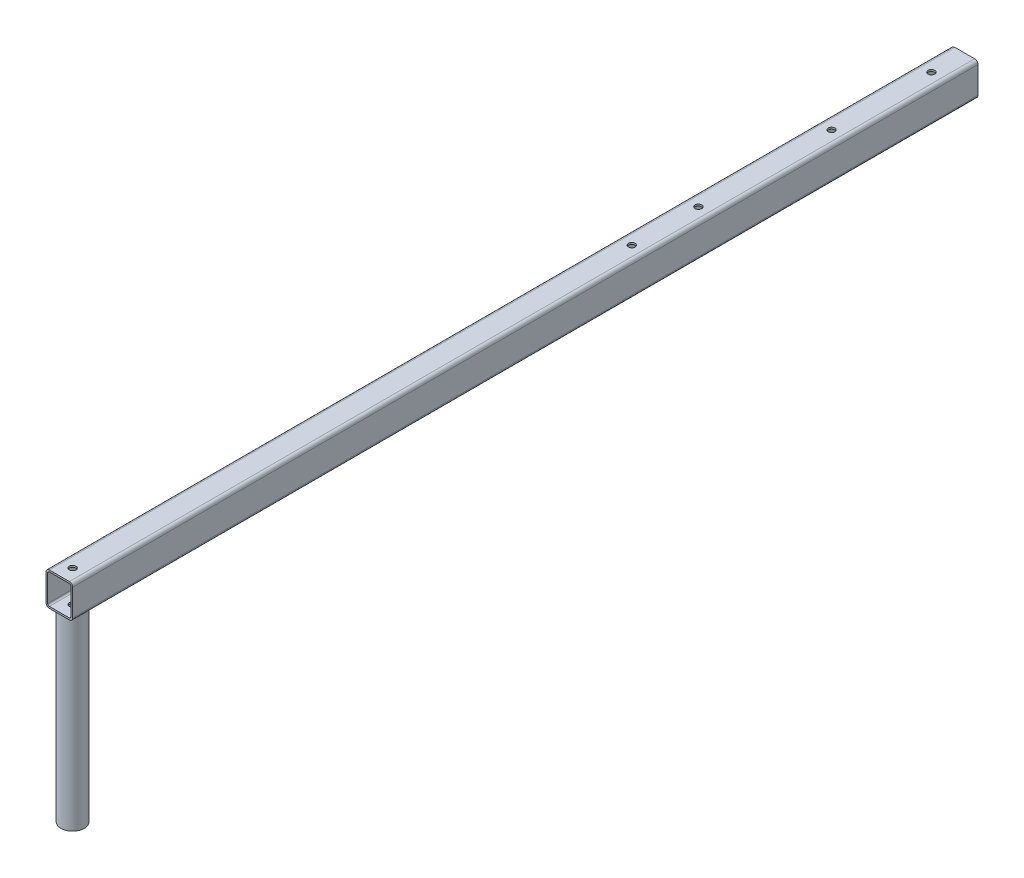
ISO-10303-21;
HEADER;
FILE_DESCRIPTION(('STEP AP214'),'2;1');
FILE_NAME('part.step','',(''),(''),'','','');
FILE_SCHEMA(('AUTOMOTIVE_DESIGN { 1 0 10303 214 1 1 1 1 }'));
ENDSEC;
DATA;
#1=APPLICATION_CONTEXT('core data for automotive mechanical design processes');
#2=APPLICATION_PROTOCOL_DEFINITION('international standard','automotive_design',2000,#1);
#3=PRODUCT_CONTEXT('',#1,'mechanical');
#4=PRODUCT('Part','Part','',(#3));
#5=PRODUCT_RELATED_PRODUCT_CATEGORY('part','',(#4));
#6=PRODUCT_DEFINITION_FORMATION('','',#4);
#7=PRODUCT_DEFINITION_CONTEXT('part definition',#1,'design');
#8=PRODUCT_DEFINITION('design','',#6,#7);
#9=PRODUCT_DEFINITION_SHAPE('','',#8);
#10=(LENGTH_UNIT() NAMED_UNIT(*) SI_UNIT(.MILLI.,.METRE.));
#11=(NAMED_UNIT(*) PLANE_ANGLE_UNIT() SI_UNIT($,.RADIAN.));
#12=(NAMED_UNIT(*) SI_UNIT($,.STERADIAN.) SOLID_ANGLE_UNIT());
#13=UNCERTAINTY_MEASURE_WITH_UNIT(LENGTH_MEASURE(1.E-05),#10,'distance_accuracy_value','');
#14=(GEOMETRIC_REPRESENTATION_CONTEXT(3) GLOBAL_UNCERTAINTY_ASSIGNED_CONTEXT((#13)) GLOBAL_UNIT_ASSIGNED_CONTEXT((#10,
#11,#12)) REPRESENTATION_CONTEXT('',''));
#15=CARTESIAN_POINT('',(0.,0.,0.));
#16=DIRECTION('',(0.,0.,1.));
#17=DIRECTION('',(1.,0.,0.));
#18=AXIS2_PLACEMENT_3D('',#15,#16,#17);
#19=CARTESIAN_POINT('',(0.,-193.675,850.9));
#20=DIRECTION('',(0.,1.,0.));
#21=DIRECTION('',(0.,0.,1.));
#22=AXIS2_PLACEMENT_3D('',#19,#20,#21);
#23=CYLINDRICAL_SURFACE('',#22,11.1125);
#24=CARTESIAN_POINT('',(0.,-193.675,850.9));
#25=DIRECTION('',(0.,1.,0.));
#26=DIRECTION('',(0.,0.,1.));
#27=AXIS2_PLACEMENT_3D('',#24,#25,#26);
#28=CIRCLE('',#27,11.1125);
#29=CARTESIAN_POINT('',(0.,-193.675,862.0125));
#30=VERTEX_POINT('',#29);
#31=EDGE_CURVE('E12',#30,#30,#28,.T.);
#32=ORIENTED_EDGE('',*,*,#31,.T.);
#33=EDGE_LOOP('',(#32));
#34=FACE_BOUND('',#33,.T.);
#35=CARTESIAN_POINT('',(0.,-15.875,850.9));
#36=DIRECTION('',(0.,1.,0.));
#37=DIRECTION('',(0.,0.,1.));
#38=AXIS2_PLACEMENT_3D('',#35,#36,#37);
#39=CIRCLE('',#38,11.1125);
#40=CARTESIAN_POINT('',(0.,-15.875,862.0125));
#41=VERTEX_POINT('',#40);
#42=EDGE_CURVE('E74',#41,#41,#39,.T.);
#43=ORIENTED_EDGE('',*,*,#42,.F.);
#44=EDGE_LOOP('',(#43));
#45=FACE_BOUND('',#44,.T.);
#46=ADVANCED_FACE('F71',(#34,#45),#23,.T.);
#47=CARTESIAN_POINT('',(0.,-193.675,850.9));
#48=DIRECTION('',(0.,1.,0.));
#49=DIRECTION('',(0.,0.,1.));
#50=AXIS2_PLACEMENT_3D('',#47,#48,#49);
#51=PLANE('',#50);
#52=CARTESIAN_POINT('',(0.,-193.675,850.9));
#53=DIRECTION('',(0.,1.,0.));
#54=DIRECTION('',(1.,0.,0.));
#55=AXIS2_PLACEMENT_3D('',#52,#53,#54);
#56=CIRCLE('',#55,9.46150000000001);
#57=CARTESIAN_POINT('',(9.46150000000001,-193.675,850.9));
#58=VERTEX_POINT('',#57);
#59=EDGE_CURVE('E81',#58,#58,#56,.T.);
#60=ORIENTED_EDGE('',*,*,#59,.T.);
#61=EDGE_LOOP('',(#60));
#62=FACE_BOUND('',#61,.T.);
#63=ORIENTED_EDGE('',*,*,#31,.F.);
#64=EDGE_LOOP('',(#63));
#65=FACE_BOUND('',#64,.T.);
#66=ADVANCED_FACE('F89',(#62,#65),#51,.F.);
#67=CARTESIAN_POINT('',(0.,-15.875,850.9));
#68=DIRECTION('',(0.,1.,0.));
#69=DIRECTION('',(0.,0.,1.));
#70=AXIS2_PLACEMENT_3D('',#67,#68,#69);
#71=PLANE('',#70);
#72=CARTESIAN_POINT('',(0.,-15.875,850.9));
#73=DIRECTION('',(0.,1.,0.));
#74=DIRECTION('',(1.,0.,0.));
#75=AXIS2_PLACEMENT_3D('',#72,#73,#74);
#76=CIRCLE('',#75,9.46150000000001);
#77=CARTESIAN_POINT('',(9.46150000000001,-15.875,850.9));
#78=VERTEX_POINT('',#77);
#79=EDGE_CURVE('E83',#78,#78,#76,.T.);
#80=ORIENTED_EDGE('',*,*,#79,.F.);
#81=EDGE_LOOP('',(#80));
#82=FACE_BOUND('',#81,.T.);
#83=ORIENTED_EDGE('',*,*,#42,.T.);
#84=EDGE_LOOP('',(#83));
#85=FACE_BOUND('',#84,.T.);
#86=ADVANCED_FACE('F95',(#82,#85),#71,.T.);
#87=CARTESIAN_POINT('',(0.,-193.675,850.9));
#88=DIRECTION('',(0.,1.,0.));
#89=DIRECTION('',(0.,0.,1.));
#90=AXIS2_PLACEMENT_3D('',#87,#88,#89);
#91=CYLINDRICAL_SURFACE('',#90,9.46150000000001);
#92=ORIENTED_EDGE('',*,*,#59,.F.);
#93=EDGE_LOOP('',(#92));
#94=FACE_BOUND('',#93,.T.);
#95=ORIENTED_EDGE('',*,*,#79,.T.);
#96=EDGE_LOOP('',(#95));
#97=FACE_BOUND('',#96,.T.);
#98=ADVANCED_FACE('F92',(#94,#97),#91,.F.);
#99=CLOSED_SHELL('',(#46,#66,#86,#98));
#100=MANIFOLD_SOLID_BREP('B2',#99);
#101=CARTESIAN_POINT('',(0.,0.,863.6));
#102=DIRECTION('',(0.,0.,1.));
#103=DIRECTION('',(1.,0.,0.));
#104=AXIS2_PLACEMENT_3D('',#101,#102,#103);
#105=PLANE('',#104);
#106=DIRECTION('',(1.,0.,0.));
#107=VECTOR('',#106,1.);
#108=CARTESIAN_POINT('',(12.7,-15.875,863.6));
#109=LINE('',#108,#107);
#110=CARTESIAN_POINT('',(-9.525,-15.875,863.6));
#111=VERTEX_POINT('',#110);
#112=CARTESIAN_POINT('',(9.525,-15.875,863.6));
#113=VERTEX_POINT('',#112);
#114=EDGE_CURVE('E427',#111,#113,#109,.T.);
#115=ORIENTED_EDGE('',*,*,#114,.T.);
#116=CARTESIAN_POINT('',(9.525,-12.7,863.6));
#117=DIRECTION('',(0.,0.,1.));
#118=DIRECTION('',(1.,0.,0.));
#119=AXIS2_PLACEMENT_3D('',#116,#117,#118);
#120=CIRCLE('',#119,3.175);
#121=CARTESIAN_POINT('',(12.7,-12.7,863.6));
#122=VERTEX_POINT('',#121);
#123=EDGE_CURVE('E301',#113,#122,#120,.T.);
#124=ORIENTED_EDGE('',*,*,#123,.T.);
#125=DIRECTION('',(0.,1.,0.));
#126=VECTOR('',#125,1.);
#127=CARTESIAN_POINT('',(12.7,15.875,863.6));
#128=LINE('',#127,#126);
#129=CARTESIAN_POINT('',(12.7,12.7,863.6));
#130=VERTEX_POINT('',#129);
#131=EDGE_CURVE('E269',#122,#130,#128,.T.);
#132=ORIENTED_EDGE('',*,*,#131,.T.);
#133=CARTESIAN_POINT('',(9.525,12.7,863.6));
#134=DIRECTION('',(0.,0.,1.));
#135=DIRECTION('',(1.,0.,0.));
#136=AXIS2_PLACEMENT_3D('',#133,#134,#135);
#137=CIRCLE('',#136,3.175);
#138=CARTESIAN_POINT('',(9.525,15.875,863.6));
#139=VERTEX_POINT('',#138);
#140=EDGE_CURVE('E295',#130,#139,#137,.T.);
#141=ORIENTED_EDGE('',*,*,#140,.T.);
#142=DIRECTION('',(-1.,0.,0.));
#143=VECTOR('',#142,1.);
#144=CARTESIAN_POINT('',(12.7,15.875,863.6));
#145=LINE('',#144,#143);
#146=CARTESIAN_POINT('',(-9.525,15.875,863.6));
#147=VERTEX_POINT('',#146);
#148=EDGE_CURVE('E286',#139,#147,#145,.T.);
#149=ORIENTED_EDGE('',*,*,#148,.T.);
#150=CARTESIAN_POINT('',(-9.525,12.7,863.6));
#151=DIRECTION('',(0.,0.,1.));
#152=DIRECTION('',(1.,0.,0.));
#153=AXIS2_PLACEMENT_3D('',#150,#151,#152);
#154=CIRCLE('',#153,3.175);
#155=CARTESIAN_POINT('',(-12.7,12.7,863.6));
#156=VERTEX_POINT('',#155);
#157=EDGE_CURVE('E297',#147,#156,#154,.T.);
#158=ORIENTED_EDGE('',*,*,#157,.T.);
#159=DIRECTION('',(0.,-1.,0.));
#160=VECTOR('',#159,1.);
#161=CARTESIAN_POINT('',(-12.7,15.875,863.6));
#162=LINE('',#161,#160);
#163=CARTESIAN_POINT('',(-12.7,-12.7,863.6));
#164=VERTEX_POINT('',#163);
#165=EDGE_CURVE('E280',#156,#164,#162,.T.);
#166=ORIENTED_EDGE('',*,*,#165,.T.);
#167=CARTESIAN_POINT('',(-9.525,-12.7,863.6));
#168=DIRECTION('',(0.,0.,1.));
#169=DIRECTION('',(1.,0.,0.));
#170=AXIS2_PLACEMENT_3D('',#167,#168,#169);
#171=CIRCLE('',#170,3.175);
#172=EDGE_CURVE('E299',#164,#111,#171,.T.);
#173=ORIENTED_EDGE('',*,*,#172,.T.);
#174=EDGE_LOOP('',(#115,#124,#132,#141,#149,#158,#166,#173));
#175=FACE_BOUND('',#174,.T.);
#176=DIRECTION('',(1.,0.,0.));
#177=VECTOR('',#176,1.);
#178=CARTESIAN_POINT('',(0.,-14.224,863.6));
#179=LINE('',#178,#177);
#180=CARTESIAN_POINT('',(-9.4742,-14.224,863.6));
#181=VERTEX_POINT('',#180);
#182=CARTESIAN_POINT('',(9.4742,-14.224,863.6));
#183=VERTEX_POINT('',#182);
#184=EDGE_CURVE('E405',#181,#183,#179,.T.);
#185=ORIENTED_EDGE('',*,*,#184,.F.);
#186=CARTESIAN_POINT('',(-9.4742,-12.6492,863.6));
#187=DIRECTION('',(0.,0.,1.));
#188=DIRECTION('',(1.,0.,0.));
#189=AXIS2_PLACEMENT_3D('',#186,#187,#188);
#190=CIRCLE('',#189,1.5748);
#191=CARTESIAN_POINT('',(-11.049,-12.6492,863.6));
#192=VERTEX_POINT('',#191);
#193=EDGE_CURVE('E150',#181,#192,#190,.F.);
#194=ORIENTED_EDGE('',*,*,#193,.T.);
#195=DIRECTION('',(0.,-1.,0.));
#196=VECTOR('',#195,1.);
#197=CARTESIAN_POINT('',(-11.049,0.,863.6));
#198=LINE('',#197,#196);
#199=CARTESIAN_POINT('',(-11.049,12.6492,863.6));
#200=VERTEX_POINT('',#199);
#201=EDGE_CURVE('E403',#200,#192,#198,.T.);
#202=ORIENTED_EDGE('',*,*,#201,.F.);
#203=CARTESIAN_POINT('',(-9.4742,12.6492,863.6));
#204=DIRECTION('',(0.,0.,1.));
#205=DIRECTION('',(1.,0.,0.));
#206=AXIS2_PLACEMENT_3D('',#203,#204,#205);
#207=CIRCLE('',#206,1.5748);
#208=CARTESIAN_POINT('',(-9.4742,14.224,863.6));
#209=VERTEX_POINT('',#208);
#210=EDGE_CURVE('E69',#200,#209,#207,.F.);
#211=ORIENTED_EDGE('',*,*,#210,.T.);
#212=DIRECTION('',(-1.,0.,0.));
#213=VECTOR('',#212,1.);
#214=CARTESIAN_POINT('',(0.,14.224,863.6));
#215=LINE('',#214,#213);
#216=CARTESIAN_POINT('',(9.4742,14.224,863.6));
#217=VERTEX_POINT('',#216);
#218=EDGE_CURVE('E412',#217,#209,#215,.T.);
#219=ORIENTED_EDGE('',*,*,#218,.F.);
#220=CARTESIAN_POINT('',(9.4742,12.6492,863.6));
#221=DIRECTION('',(0.,0.,1.));
#222=DIRECTION('',(1.,0.,0.));
#223=AXIS2_PLACEMENT_3D('',#220,#221,#222);
#224=CIRCLE('',#223,1.5748);
#225=CARTESIAN_POINT('',(11.049,12.6492,863.6));
#226=VERTEX_POINT('',#225);
#227=EDGE_CURVE('E334',#217,#226,#224,.F.);
#228=ORIENTED_EDGE('',*,*,#227,.T.);
#229=DIRECTION('',(0.,1.,0.));
#230=VECTOR('',#229,1.);
#231=CARTESIAN_POINT('',(11.049,0.,863.6));
#232=LINE('',#231,#230);
#233=CARTESIAN_POINT('',(11.049,-12.6492,863.6));
#234=VERTEX_POINT('',#233);
#235=EDGE_CURVE('E409',#234,#226,#232,.T.);
#236=ORIENTED_EDGE('',*,*,#235,.F.);
#237=CARTESIAN_POINT('',(9.4742,-12.6492,863.6));
#238=DIRECTION('',(0.,0.,1.));
#239=DIRECTION('',(1.,0.,0.));
#240=AXIS2_PLACEMENT_3D('',#237,#238,#239);
#241=CIRCLE('',#240,1.5748);
#242=EDGE_CURVE('E338',#234,#183,#241,.F.);
#243=ORIENTED_EDGE('',*,*,#242,.T.);
#244=EDGE_LOOP('',(#185,#194,#202,#211,#219,#228,#236,#243));
#245=FACE_BOUND('',#244,.T.);
#246=ADVANCED_FACE('F133',(#175,#245),#105,.T.);
#247=CARTESIAN_POINT('',(0.,0.,0.));
#248=DIRECTION('',(0.,0.,1.));
#249=DIRECTION('',(1.,0.,0.));
#250=AXIS2_PLACEMENT_3D('',#247,#248,#249);
#251=PLANE('',#250);
#252=DIRECTION('',(0.,1.,0.));
#253=VECTOR('',#252,1.);
#254=CARTESIAN_POINT('',(12.7,15.875,0.));
#255=LINE('',#254,#253);
#256=CARTESIAN_POINT('',(12.7,-12.7,0.));
#257=VERTEX_POINT('',#256);
#258=CARTESIAN_POINT('',(12.7,12.7,0.));
#259=VERTEX_POINT('',#258);
#260=EDGE_CURVE('E266',#257,#259,#255,.T.);
#261=ORIENTED_EDGE('',*,*,#260,.F.);
#262=CARTESIAN_POINT('',(9.525,-12.7,0.));
#263=DIRECTION('',(0.,0.,1.));
#264=DIRECTION('',(1.,0.,0.));
#265=AXIS2_PLACEMENT_3D('',#262,#263,#264);
#266=CIRCLE('',#265,3.175);
#267=CARTESIAN_POINT('',(9.525,-15.875,0.));
#268=VERTEX_POINT('',#267);
#269=EDGE_CURVE('E249',#257,#268,#266,.F.);
#270=ORIENTED_EDGE('',*,*,#269,.T.);
#271=DIRECTION('',(1.,0.,0.));
#272=VECTOR('',#271,1.);
#273=CARTESIAN_POINT('',(12.7,-15.875,0.));
#274=LINE('',#273,#272);
#275=CARTESIAN_POINT('',(-9.525,-15.875,0.));
#276=VERTEX_POINT('',#275);
#277=EDGE_CURVE('E277',#276,#268,#274,.T.);
#278=ORIENTED_EDGE('',*,*,#277,.F.);
#279=CARTESIAN_POINT('',(-9.525,-12.7,0.));
#280=DIRECTION('',(0.,0.,1.));
#281=DIRECTION('',(1.,0.,0.));
#282=AXIS2_PLACEMENT_3D('',#279,#280,#281);
#283=CIRCLE('',#282,3.175);
#284=CARTESIAN_POINT('',(-12.7,-12.7,0.));
#285=VERTEX_POINT('',#284);
#286=EDGE_CURVE('E260',#276,#285,#283,.F.);
#287=ORIENTED_EDGE('',*,*,#286,.T.);
#288=DIRECTION('',(0.,-1.,0.));
#289=VECTOR('',#288,1.);
#290=CARTESIAN_POINT('',(-12.7,15.875,0.));
#291=LINE('',#290,#289);
#292=CARTESIAN_POINT('',(-12.7,12.7,0.));
#293=VERTEX_POINT('',#292);
#294=EDGE_CURVE('E282',#293,#285,#291,.T.);
#295=ORIENTED_EDGE('',*,*,#294,.F.);
#296=CARTESIAN_POINT('',(-9.525,12.7,0.));
#297=DIRECTION('',(0.,0.,1.));
#298=DIRECTION('',(1.,0.,0.));
#299=AXIS2_PLACEMENT_3D('',#296,#297,#298);
#300=CIRCLE('',#299,3.175);
#301=CARTESIAN_POINT('',(-9.525,15.875,0.));
#302=VERTEX_POINT('',#301);
#303=EDGE_CURVE('E289',#293,#302,#300,.F.);
#304=ORIENTED_EDGE('',*,*,#303,.T.);
#305=DIRECTION('',(-1.,0.,0.));
#306=VECTOR('',#305,1.);
#307=CARTESIAN_POINT('',(12.7,15.875,0.));
#308=LINE('',#307,#306);
#309=CARTESIAN_POINT('',(9.525,15.875,0.));
#310=VERTEX_POINT('',#309);
#311=EDGE_CURVE('E276',#310,#302,#308,.T.);
#312=ORIENTED_EDGE('',*,*,#311,.F.);
#313=CARTESIAN_POINT('',(9.525,12.7,0.));
#314=DIRECTION('',(0.,0.,1.));
#315=DIRECTION('',(1.,0.,0.));
#316=AXIS2_PLACEMENT_3D('',#313,#314,#315);
#317=CIRCLE('',#316,3.175);
#318=EDGE_CURVE('E270',#310,#259,#317,.F.);
#319=ORIENTED_EDGE('',*,*,#318,.T.);
#320=EDGE_LOOP('',(#261,#270,#278,#287,#295,#304,#312,#319));
#321=FACE_BOUND('',#320,.T.);
#322=DIRECTION('',(-1.,0.,0.));
#323=VECTOR('',#322,1.);
#324=CARTESIAN_POINT('',(0.,14.224,0.));
#325=LINE('',#324,#323);
#326=CARTESIAN_POINT('',(9.4742,14.224,0.));
#327=VERTEX_POINT('',#326);
#328=CARTESIAN_POINT('',(-9.4742,14.224,0.));
#329=VERTEX_POINT('',#328);
#330=EDGE_CURVE('E406',#327,#329,#325,.T.);
#331=ORIENTED_EDGE('',*,*,#330,.T.);
#332=CARTESIAN_POINT('',(-9.4742,12.6492,0.));
#333=DIRECTION('',(0.,0.,1.));
#334=DIRECTION('',(1.,0.,0.));
#335=AXIS2_PLACEMENT_3D('',#332,#333,#334);
#336=CIRCLE('',#335,1.5748);
#337=CARTESIAN_POINT('',(-11.049,12.6492,0.));
#338=VERTEX_POINT('',#337);
#339=EDGE_CURVE('E142',#329,#338,#336,.T.);
#340=ORIENTED_EDGE('',*,*,#339,.T.);
#341=DIRECTION('',(0.,-1.,0.));
#342=VECTOR('',#341,1.);
#343=CARTESIAN_POINT('',(-11.049,0.,0.));
#344=LINE('',#343,#342);
#345=CARTESIAN_POINT('',(-11.049,-12.6492,0.));
#346=VERTEX_POINT('',#345);
#347=EDGE_CURVE('E402',#338,#346,#344,.T.);
#348=ORIENTED_EDGE('',*,*,#347,.T.);
#349=CARTESIAN_POINT('',(-9.4742,-12.6492,0.));
#350=DIRECTION('',(0.,0.,1.));
#351=DIRECTION('',(1.,0.,0.));
#352=AXIS2_PLACEMENT_3D('',#349,#350,#351);
#353=CIRCLE('',#352,1.5748);
#354=CARTESIAN_POINT('',(-9.4742,-14.224,0.));
#355=VERTEX_POINT('',#354);
#356=EDGE_CURVE('E340',#346,#355,#353,.T.);
#357=ORIENTED_EDGE('',*,*,#356,.T.);
#358=DIRECTION('',(1.,0.,0.));
#359=VECTOR('',#358,1.);
#360=CARTESIAN_POINT('',(0.,-14.224,0.));
#361=LINE('',#360,#359);
#362=CARTESIAN_POINT('',(9.4742,-14.224,0.));
#363=VERTEX_POINT('',#362);
#364=EDGE_CURVE('E417',#355,#363,#361,.T.);
#365=ORIENTED_EDGE('',*,*,#364,.T.);
#366=CARTESIAN_POINT('',(9.4742,-12.6492,0.));
#367=DIRECTION('',(0.,0.,1.));
#368=DIRECTION('',(1.,0.,0.));
#369=AXIS2_PLACEMENT_3D('',#366,#367,#368);
#370=CIRCLE('',#369,1.5748);
#371=CARTESIAN_POINT('',(11.049,-12.6492,0.));
#372=VERTEX_POINT('',#371);
#373=EDGE_CURVE('E336',#363,#372,#370,.T.);
#374=ORIENTED_EDGE('',*,*,#373,.T.);
#375=DIRECTION('',(0.,1.,0.));
#376=VECTOR('',#375,1.);
#377=CARTESIAN_POINT('',(11.049,0.,0.));
#378=LINE('',#377,#376);
#379=CARTESIAN_POINT('',(11.049,12.6492,0.));
#380=VERTEX_POINT('',#379);
#381=EDGE_CURVE('E420',#372,#380,#378,.T.);
#382=ORIENTED_EDGE('',*,*,#381,.T.);
#383=CARTESIAN_POINT('',(9.4742,12.6492,0.));
#384=DIRECTION('',(0.,0.,1.));
#385=DIRECTION('',(1.,0.,0.));
#386=AXIS2_PLACEMENT_3D('',#383,#384,#385);
#387=CIRCLE('',#386,1.5748);
#388=EDGE_CURVE('E332',#380,#327,#387,.T.);
#389=ORIENTED_EDGE('',*,*,#388,.T.);
#390=EDGE_LOOP('',(#331,#340,#348,#357,#365,#374,#382,#389));
#391=FACE_BOUND('',#390,.T.);
#392=ADVANCED_FACE('F273',(#321,#391),#251,.F.);
#393=CARTESIAN_POINT('',(-12.7,15.875,863.6));
#394=DIRECTION('',(1.,0.,0.));
#395=DIRECTION('',(0.,1.,0.));
#396=AXIS2_PLACEMENT_3D('',#393,#394,#395);
#397=PLANE('',#396);
#398=ORIENTED_EDGE('',*,*,#294,.T.);
#399=DIRECTION('',(0.,0.,-1.));
#400=VECTOR('',#399,1.);
#401=CARTESIAN_POINT('',(-12.7,-12.7,863.6));
#402=LINE('',#401,#400);
#403=EDGE_CURVE('E306',#285,#164,#402,.F.);
#404=ORIENTED_EDGE('',*,*,#403,.T.);
#405=ORIENTED_EDGE('',*,*,#165,.F.);
#406=DIRECTION('',(0.,0.,-1.));
#407=VECTOR('',#406,1.);
#408=CARTESIAN_POINT('',(-12.7,12.7,863.6));
#409=LINE('',#408,#407);
#410=EDGE_CURVE('E303',#156,#293,#409,.T.);
#411=ORIENTED_EDGE('',*,*,#410,.T.);
#412=EDGE_LOOP('',(#398,#404,#405,#411));
#413=FACE_BOUND('',#412,.T.);
#414=ADVANCED_FACE('F436',(#413),#397,.F.);
#415=CARTESIAN_POINT('',(12.7,-15.875,863.6));
#416=DIRECTION('',(0.,1.,0.));
#417=DIRECTION('',(0.,0.,1.));
#418=AXIS2_PLACEMENT_3D('',#415,#416,#417);
#419=PLANE('',#418);
#420=CARTESIAN_POINT('',(0.,-15.875,850.9));
#421=DIRECTION('',(0.,1.,0.));
#422=DIRECTION('',(0.,0.,1.));
#423=AXIS2_PLACEMENT_3D('',#420,#421,#422);
#424=CIRCLE('',#423,3.175);
#425=CARTESIAN_POINT('',(0.,-15.875,854.075));
#426=VERTEX_POINT('',#425);
#427=EDGE_CURVE('E361',#426,#426,#424,.T.);
#428=ORIENTED_EDGE('',*,*,#427,.T.);
#429=EDGE_LOOP('',(#428));
#430=FACE_BOUND('',#429,.T.);
#431=CARTESIAN_POINT('',(0.,-15.875,317.5));
#432=DIRECTION('',(0.,1.,0.));
#433=DIRECTION('',(0.,0.,1.));
#434=AXIS2_PLACEMENT_3D('',#431,#432,#433);
#435=CIRCLE('',#434,3.175);
#436=CARTESIAN_POINT('',(0.,-15.875,320.675));
#437=VERTEX_POINT('',#436);
#438=EDGE_CURVE('E357',#437,#437,#435,.T.);
#439=ORIENTED_EDGE('',*,*,#438,.T.);
#440=EDGE_LOOP('',(#439));
#441=FACE_BOUND('',#440,.T.);
#442=CARTESIAN_POINT('',(0.,-15.875,254.));
#443=DIRECTION('',(0.,1.,0.));
#444=DIRECTION('',(0.,0.,1.));
#445=AXIS2_PLACEMENT_3D('',#442,#443,#444);
#446=CIRCLE('',#445,3.175);
#447=CARTESIAN_POINT('',(0.,-15.875,257.175));
#448=VERTEX_POINT('',#447);
#449=EDGE_CURVE('E353',#448,#448,#446,.T.);
#450=ORIENTED_EDGE('',*,*,#449,.T.);
#451=EDGE_LOOP('',(#450));
#452=FACE_BOUND('',#451,.T.);
#453=CARTESIAN_POINT('',(0.,-15.875,127.));
#454=DIRECTION('',(0.,1.,0.));
#455=DIRECTION('',(0.,0.,1.));
#456=AXIS2_PLACEMENT_3D('',#453,#454,#455);
#457=CIRCLE('',#456,3.175);
#458=CARTESIAN_POINT('',(0.,-15.875,130.175));
#459=VERTEX_POINT('',#458);
#460=EDGE_CURVE('E348',#459,#459,#457,.T.);
#461=ORIENTED_EDGE('',*,*,#460,.T.);
#462=EDGE_LOOP('',(#461));
#463=FACE_BOUND('',#462,.T.);
#464=CARTESIAN_POINT('',(0.,-15.875,31.75));
#465=DIRECTION('',(0.,1.,0.));
#466=DIRECTION('',(0.,0.,1.));
#467=AXIS2_PLACEMENT_3D('',#464,#465,#466);
#468=CIRCLE('',#467,3.175);
#469=CARTESIAN_POINT('',(0.,-15.875,34.925));
#470=VERTEX_POINT('',#469);
#471=EDGE_CURVE('E399',#470,#470,#468,.T.);
#472=ORIENTED_EDGE('',*,*,#471,.T.);
#473=EDGE_LOOP('',(#472));
#474=FACE_BOUND('',#473,.T.);
#475=ORIENTED_EDGE('',*,*,#277,.T.);
#476=DIRECTION('',(0.,0.,-1.));
#477=VECTOR('',#476,1.);
#478=CARTESIAN_POINT('',(9.525,-15.875,863.6));
#479=LINE('',#478,#477);
#480=EDGE_CURVE('E254',#268,#113,#479,.F.);
#481=ORIENTED_EDGE('',*,*,#480,.T.);
#482=ORIENTED_EDGE('',*,*,#114,.F.);
#483=DIRECTION('',(0.,0.,-1.));
#484=VECTOR('',#483,1.);
#485=CARTESIAN_POINT('',(-9.525,-15.875,863.6));
#486=LINE('',#485,#484);
#487=EDGE_CURVE('E259',#111,#276,#486,.T.);
#488=ORIENTED_EDGE('',*,*,#487,.T.);
#489=EDGE_LOOP('',(#475,#481,#482,#488));
#490=FACE_BOUND('',#489,.T.);
#491=ADVANCED_FACE('F446',(#430,#441,#452,#463,#474,#490),#419,.F.);
#492=CARTESIAN_POINT('',(12.7,15.875,863.6));
#493=DIRECTION('',(-1.,0.,0.));
#494=DIRECTION('',(0.,-1.,0.));
#495=AXIS2_PLACEMENT_3D('',#492,#493,#494);
#496=PLANE('',#495);
#497=ORIENTED_EDGE('',*,*,#131,.F.);
#498=DIRECTION('',(0.,0.,-1.));
#499=VECTOR('',#498,1.);
#500=CARTESIAN_POINT('',(12.7,-12.7,863.6));
#501=LINE('',#500,#499);
#502=EDGE_CURVE('E253',#122,#257,#501,.T.);
#503=ORIENTED_EDGE('',*,*,#502,.T.);
#504=ORIENTED_EDGE('',*,*,#260,.T.);
#505=DIRECTION('',(0.,0.,-1.));
#506=VECTOR('',#505,1.);
#507=CARTESIAN_POINT('',(12.7,12.7,863.6));
#508=LINE('',#507,#506);
#509=EDGE_CURVE('E271',#259,#130,#508,.F.);
#510=ORIENTED_EDGE('',*,*,#509,.T.);
#511=EDGE_LOOP('',(#497,#503,#504,#510));
#512=FACE_BOUND('',#511,.T.);
#513=ADVANCED_FACE('F265',(#512),#496,.F.);
#514=CARTESIAN_POINT('',(12.7,15.875,863.6));
#515=DIRECTION('',(0.,-1.,0.));
#516=DIRECTION('',(0.,0.,-1.));
#517=AXIS2_PLACEMENT_3D('',#514,#515,#516);
#518=PLANE('',#517);
#519=CARTESIAN_POINT('',(0.,15.875,850.9));
#520=DIRECTION('',(0.,1.,0.));
#521=DIRECTION('',(0.,0.,1.));
#522=AXIS2_PLACEMENT_3D('',#519,#520,#521);
#523=CIRCLE('',#522,3.175);
#524=CARTESIAN_POINT('',(0.,15.875,854.075));
#525=VERTEX_POINT('',#524);
#526=EDGE_CURVE('E476',#525,#525,#523,.T.);
#527=ORIENTED_EDGE('',*,*,#526,.F.);
#528=EDGE_LOOP('',(#527));
#529=FACE_BOUND('',#528,.T.);
#530=CARTESIAN_POINT('',(0.,15.875,317.5));
#531=DIRECTION('',(0.,-1.,0.));
#532=DIRECTION('',(0.,0.,-1.));
#533=AXIS2_PLACEMENT_3D('',#530,#531,#532);
#534=CIRCLE('',#533,3.175);
#535=CARTESIAN_POINT('',(0.,15.875,314.325));
#536=VERTEX_POINT('',#535);
#537=EDGE_CURVE('E365',#536,#536,#534,.T.);
#538=ORIENTED_EDGE('',*,*,#537,.T.);
#539=EDGE_LOOP('',(#538));
#540=FACE_BOUND('',#539,.T.);
#541=CARTESIAN_POINT('',(0.,15.875,254.));
#542=DIRECTION('',(0.,-1.,0.));
#543=DIRECTION('',(0.,0.,-1.));
#544=AXIS2_PLACEMENT_3D('',#541,#542,#543);
#545=CIRCLE('',#544,3.175);
#546=CARTESIAN_POINT('',(0.,15.875,250.825));
#547=VERTEX_POINT('',#546);
#548=EDGE_CURVE('E382',#547,#547,#545,.T.);
#549=ORIENTED_EDGE('',*,*,#548,.T.);
#550=EDGE_LOOP('',(#549));
#551=FACE_BOUND('',#550,.T.);
#552=CARTESIAN_POINT('',(0.,15.875,127.));
#553=DIRECTION('',(0.,-1.,0.));
#554=DIRECTION('',(0.,0.,-1.));
#555=AXIS2_PLACEMENT_3D('',#552,#553,#554);
#556=CIRCLE('',#555,3.175);
#557=CARTESIAN_POINT('',(0.,15.875,123.825));
#558=VERTEX_POINT('',#557);
#559=EDGE_CURVE('E389',#558,#558,#556,.T.);
#560=ORIENTED_EDGE('',*,*,#559,.T.);
#561=EDGE_LOOP('',(#560));
#562=FACE_BOUND('',#561,.T.);
#563=CARTESIAN_POINT('',(0.,15.875,31.75));
#564=DIRECTION('',(0.,-1.,0.));
#565=DIRECTION('',(0.,0.,-1.));
#566=AXIS2_PLACEMENT_3D('',#563,#564,#565);
#567=CIRCLE('',#566,3.175);
#568=CARTESIAN_POINT('',(0.,15.875,28.575));
#569=VERTEX_POINT('',#568);
#570=EDGE_CURVE('E396',#569,#569,#567,.T.);
#571=ORIENTED_EDGE('',*,*,#570,.T.);
#572=EDGE_LOOP('',(#571));
#573=FACE_BOUND('',#572,.T.);
#574=ORIENTED_EDGE('',*,*,#311,.T.);
#575=DIRECTION('',(0.,0.,-1.));
#576=VECTOR('',#575,1.);
#577=CARTESIAN_POINT('',(-9.525,15.875,863.6));
#578=LINE('',#577,#576);
#579=EDGE_CURVE('E311',#302,#147,#578,.F.);
#580=ORIENTED_EDGE('',*,*,#579,.T.);
#581=ORIENTED_EDGE('',*,*,#148,.F.);
#582=DIRECTION('',(0.,0.,-1.));
#583=VECTOR('',#582,1.);
#584=CARTESIAN_POINT('',(9.525,15.875,863.6));
#585=LINE('',#584,#583);
#586=EDGE_CURVE('E308',#139,#310,#585,.T.);
#587=ORIENTED_EDGE('',*,*,#586,.T.);
#588=EDGE_LOOP('',(#574,#580,#581,#587));
#589=FACE_BOUND('',#588,.T.);
#590=ADVANCED_FACE('F453',(#529,#540,#551,#562,#573,#589),#518,.F.);
#591=CARTESIAN_POINT('',(-11.049,0.,863.6));
#592=DIRECTION('',(1.,0.,0.));
#593=DIRECTION('',(0.,1.,0.));
#594=AXIS2_PLACEMENT_3D('',#591,#592,#593);
#595=PLANE('',#594);
#596=ORIENTED_EDGE('',*,*,#201,.T.);
#597=DIRECTION('',(0.,0.,-1.));
#598=VECTOR('',#597,1.);
#599=CARTESIAN_POINT('',(-11.049,-12.6492,0.));
#600=LINE('',#599,#598);
#601=EDGE_CURVE('E329',#192,#346,#600,.T.);
#602=ORIENTED_EDGE('',*,*,#601,.T.);
#603=ORIENTED_EDGE('',*,*,#347,.F.);
#604=DIRECTION('',(0.,0.,-1.));
#605=VECTOR('',#604,1.);
#606=CARTESIAN_POINT('',(-11.049,12.6492,863.6));
#607=LINE('',#606,#605);
#608=EDGE_CURVE('E157',#338,#200,#607,.F.);
#609=ORIENTED_EDGE('',*,*,#608,.T.);
#610=EDGE_LOOP('',(#596,#602,#603,#609));
#611=FACE_BOUND('',#610,.T.);
#612=ADVANCED_FACE('F464',(#611),#595,.T.);
#613=CARTESIAN_POINT('',(0.,-14.224,863.6));
#614=DIRECTION('',(0.,1.,0.));
#615=DIRECTION('',(0.,0.,1.));
#616=AXIS2_PLACEMENT_3D('',#613,#614,#615);
#617=PLANE('',#616);
#618=CARTESIAN_POINT('',(0.,-14.224,850.9));
#619=DIRECTION('',(0.,1.,0.));
#620=DIRECTION('',(0.,0.,1.));
#621=AXIS2_PLACEMENT_3D('',#618,#619,#620);
#622=CIRCLE('',#621,3.175);
#623=CARTESIAN_POINT('',(0.,-14.224,854.075));
#624=VERTEX_POINT('',#623);
#625=EDGE_CURVE('E368',#624,#624,#622,.T.);
#626=ORIENTED_EDGE('',*,*,#625,.F.);
#627=EDGE_LOOP('',(#626));
#628=FACE_BOUND('',#627,.T.);
#629=CARTESIAN_POINT('',(0.,-14.224,317.5));
#630=DIRECTION('',(0.,1.,0.));
#631=DIRECTION('',(0.,0.,1.));
#632=AXIS2_PLACEMENT_3D('',#629,#630,#631);
#633=CIRCLE('',#632,3.175);
#634=CARTESIAN_POINT('',(0.,-14.224,320.675));
#635=VERTEX_POINT('',#634);
#636=EDGE_CURVE('E360',#635,#635,#633,.T.);
#637=ORIENTED_EDGE('',*,*,#636,.F.);
#638=EDGE_LOOP('',(#637));
#639=FACE_BOUND('',#638,.T.);
#640=CARTESIAN_POINT('',(0.,-14.224,254.));
#641=DIRECTION('',(0.,1.,0.));
#642=DIRECTION('',(0.,0.,1.));
#643=AXIS2_PLACEMENT_3D('',#640,#641,#642);
#644=CIRCLE('',#643,3.175);
#645=CARTESIAN_POINT('',(0.,-14.224,257.175));
#646=VERTEX_POINT('',#645);
#647=EDGE_CURVE('E356',#646,#646,#644,.T.);
#648=ORIENTED_EDGE('',*,*,#647,.F.);
#649=EDGE_LOOP('',(#648));
#650=FACE_BOUND('',#649,.T.);
#651=CARTESIAN_POINT('',(0.,-14.224,127.));
#652=DIRECTION('',(0.,1.,0.));
#653=DIRECTION('',(0.,0.,1.));
#654=AXIS2_PLACEMENT_3D('',#651,#652,#653);
#655=CIRCLE('',#654,3.175);
#656=CARTESIAN_POINT('',(0.,-14.224,130.175));
#657=VERTEX_POINT('',#656);
#658=EDGE_CURVE('E352',#657,#657,#655,.T.);
#659=ORIENTED_EDGE('',*,*,#658,.F.);
#660=EDGE_LOOP('',(#659));
#661=FACE_BOUND('',#660,.T.);
#662=CARTESIAN_POINT('',(0.,-14.224,31.75));
#663=DIRECTION('',(0.,1.,0.));
#664=DIRECTION('',(0.,0.,1.));
#665=AXIS2_PLACEMENT_3D('',#662,#663,#664);
#666=CIRCLE('',#665,3.175);
#667=CARTESIAN_POINT('',(0.,-14.224,34.925));
#668=VERTEX_POINT('',#667);
#669=EDGE_CURVE('E347',#668,#668,#666,.T.);
#670=ORIENTED_EDGE('',*,*,#669,.F.);
#671=EDGE_LOOP('',(#670));
#672=FACE_BOUND('',#671,.T.);
#673=ORIENTED_EDGE('',*,*,#184,.T.);
#674=DIRECTION('',(0.,0.,-1.));
#675=VECTOR('',#674,1.);
#676=CARTESIAN_POINT('',(9.4742,-14.224,0.));
#677=LINE('',#676,#675);
#678=EDGE_CURVE('E325',#183,#363,#677,.T.);
#679=ORIENTED_EDGE('',*,*,#678,.T.);
#680=ORIENTED_EDGE('',*,*,#364,.F.);
#681=DIRECTION('',(0.,0.,-1.));
#682=VECTOR('',#681,1.);
#683=CARTESIAN_POINT('',(-9.4742,-14.224,863.6));
#684=LINE('',#683,#682);
#685=EDGE_CURVE('E323',#355,#181,#684,.F.);
#686=ORIENTED_EDGE('',*,*,#685,.T.);
#687=EDGE_LOOP('',(#673,#679,#680,#686));
#688=FACE_BOUND('',#687,.T.);
#689=ADVANCED_FACE('F472',(#628,#639,#650,#661,#672,#688),#617,.T.);
#690=CARTESIAN_POINT('',(11.049,0.,863.6));
#691=DIRECTION('',(-1.,0.,0.));
#692=DIRECTION('',(0.,-1.,0.));
#693=AXIS2_PLACEMENT_3D('',#690,#691,#692);
#694=PLANE('',#693);
#695=ORIENTED_EDGE('',*,*,#235,.T.);
#696=DIRECTION('',(0.,0.,-1.));
#697=VECTOR('',#696,1.);
#698=CARTESIAN_POINT('',(11.049,12.6492,0.));
#699=LINE('',#698,#697);
#700=EDGE_CURVE('E315',#226,#380,#699,.T.);
#701=ORIENTED_EDGE('',*,*,#700,.T.);
#702=ORIENTED_EDGE('',*,*,#381,.F.);
#703=DIRECTION('',(0.,0.,-1.));
#704=VECTOR('',#703,1.);
#705=CARTESIAN_POINT('',(11.049,-12.6492,863.6));
#706=LINE('',#705,#704);
#707=EDGE_CURVE('E313',#372,#234,#706,.F.);
#708=ORIENTED_EDGE('',*,*,#707,.T.);
#709=EDGE_LOOP('',(#695,#701,#702,#708));
#710=FACE_BOUND('',#709,.T.);
#711=ADVANCED_FACE('F532',(#710),#694,.T.);
#712=CARTESIAN_POINT('',(0.,14.224,863.6));
#713=DIRECTION('',(0.,-1.,0.));
#714=DIRECTION('',(0.,0.,-1.));
#715=AXIS2_PLACEMENT_3D('',#712,#713,#714);
#716=PLANE('',#715);
#717=CARTESIAN_POINT('',(0.,14.224,850.9));
#718=DIRECTION('',(0.,-1.,0.));
#719=DIRECTION('',(0.,0.,-1.));
#720=AXIS2_PLACEMENT_3D('',#717,#718,#719);
#721=CIRCLE('',#720,3.175);
#722=CARTESIAN_POINT('',(0.,14.224,847.725));
#723=VERTEX_POINT('',#722);
#724=EDGE_CURVE('E137',#723,#723,#721,.T.);
#725=ORIENTED_EDGE('',*,*,#724,.F.);
#726=EDGE_LOOP('',(#725));
#727=FACE_BOUND('',#726,.T.);
#728=CARTESIAN_POINT('',(0.,14.224,317.5));
#729=DIRECTION('',(0.,-1.,0.));
#730=DIRECTION('',(0.,0.,-1.));
#731=AXIS2_PLACEMENT_3D('',#728,#729,#730);
#732=CIRCLE('',#731,3.175);
#733=CARTESIAN_POINT('',(0.,14.224,314.325));
#734=VERTEX_POINT('',#733);
#735=EDGE_CURVE('E358',#734,#734,#732,.T.);
#736=ORIENTED_EDGE('',*,*,#735,.F.);
#737=EDGE_LOOP('',(#736));
#738=FACE_BOUND('',#737,.T.);
#739=CARTESIAN_POINT('',(0.,14.224,254.));
#740=DIRECTION('',(0.,-1.,0.));
#741=DIRECTION('',(0.,0.,-1.));
#742=AXIS2_PLACEMENT_3D('',#739,#740,#741);
#743=CIRCLE('',#742,3.175);
#744=CARTESIAN_POINT('',(0.,14.224,250.825));
#745=VERTEX_POINT('',#744);
#746=EDGE_CURVE('E354',#745,#745,#743,.T.);
#747=ORIENTED_EDGE('',*,*,#746,.F.);
#748=EDGE_LOOP('',(#747));
#749=FACE_BOUND('',#748,.T.);
#750=CARTESIAN_POINT('',(0.,14.224,127.));
#751=DIRECTION('',(0.,-1.,0.));
#752=DIRECTION('',(0.,0.,-1.));
#753=AXIS2_PLACEMENT_3D('',#750,#751,#752);
#754=CIRCLE('',#753,3.175);
#755=CARTESIAN_POINT('',(0.,14.224,123.825));
#756=VERTEX_POINT('',#755);
#757=EDGE_CURVE('E349',#756,#756,#754,.T.);
#758=ORIENTED_EDGE('',*,*,#757,.F.);
#759=EDGE_LOOP('',(#758));
#760=FACE_BOUND('',#759,.T.);
#761=CARTESIAN_POINT('',(0.,14.224,31.75));
#762=DIRECTION('',(0.,-1.,0.));
#763=DIRECTION('',(0.,0.,-1.));
#764=AXIS2_PLACEMENT_3D('',#761,#762,#763);
#765=CIRCLE('',#764,3.175);
#766=CARTESIAN_POINT('',(0.,14.224,28.575));
#767=VERTEX_POINT('',#766);
#768=EDGE_CURVE('E344',#767,#767,#765,.T.);
#769=ORIENTED_EDGE('',*,*,#768,.F.);
#770=EDGE_LOOP('',(#769));
#771=FACE_BOUND('',#770,.T.);
#772=ORIENTED_EDGE('',*,*,#330,.F.);
#773=DIRECTION('',(0.,0.,-1.));
#774=VECTOR('',#773,1.);
#775=CARTESIAN_POINT('',(9.4742,14.224,863.6));
#776=LINE('',#775,#774);
#777=EDGE_CURVE('E321',#327,#217,#776,.F.);
#778=ORIENTED_EDGE('',*,*,#777,.T.);
#779=ORIENTED_EDGE('',*,*,#218,.T.);
#780=DIRECTION('',(0.,0.,-1.));
#781=VECTOR('',#780,1.);
#782=CARTESIAN_POINT('',(-9.4742,14.224,0.));
#783=LINE('',#782,#781);
#784=EDGE_CURVE('E318',#209,#329,#783,.T.);
#785=ORIENTED_EDGE('',*,*,#784,.T.);
#786=EDGE_LOOP('',(#772,#778,#779,#785));
#787=FACE_BOUND('',#786,.T.);
#788=ADVANCED_FACE('F524',(#727,#738,#749,#760,#771,#787),#716,.T.);
#789=CARTESIAN_POINT('',(9.525,-12.7,863.6));
#790=DIRECTION('',(0.,0.,-1.));
#791=DIRECTION('',(-1.,0.,0.));
#792=AXIS2_PLACEMENT_3D('',#789,#790,#791);
#793=CYLINDRICAL_SURFACE('',#792,3.175);
#794=ORIENTED_EDGE('',*,*,#123,.F.);
#795=ORIENTED_EDGE('',*,*,#480,.F.);
#796=ORIENTED_EDGE('',*,*,#269,.F.);
#797=ORIENTED_EDGE('',*,*,#502,.F.);
#798=EDGE_LOOP('',(#794,#795,#796,#797));
#799=FACE_BOUND('',#798,.T.);
#800=ADVANCED_FACE('F252',(#799),#793,.T.);
#801=CARTESIAN_POINT('',(-9.525,-12.7,863.6));
#802=DIRECTION('',(0.,0.,-1.));
#803=DIRECTION('',(-1.,0.,0.));
#804=AXIS2_PLACEMENT_3D('',#801,#802,#803);
#805=CYLINDRICAL_SURFACE('',#804,3.175);
#806=ORIENTED_EDGE('',*,*,#172,.F.);
#807=ORIENTED_EDGE('',*,*,#403,.F.);
#808=ORIENTED_EDGE('',*,*,#286,.F.);
#809=ORIENTED_EDGE('',*,*,#487,.F.);
#810=EDGE_LOOP('',(#806,#807,#808,#809));
#811=FACE_BOUND('',#810,.T.);
#812=ADVANCED_FACE('F441',(#811),#805,.T.);
#813=CARTESIAN_POINT('',(-9.525,12.7,863.6));
#814=DIRECTION('',(0.,0.,-1.));
#815=DIRECTION('',(-1.,0.,0.));
#816=AXIS2_PLACEMENT_3D('',#813,#814,#815);
#817=CYLINDRICAL_SURFACE('',#816,3.175);
#818=ORIENTED_EDGE('',*,*,#157,.F.);
#819=ORIENTED_EDGE('',*,*,#579,.F.);
#820=ORIENTED_EDGE('',*,*,#303,.F.);
#821=ORIENTED_EDGE('',*,*,#410,.F.);
#822=EDGE_LOOP('',(#818,#819,#820,#821));
#823=FACE_BOUND('',#822,.T.);
#824=ADVANCED_FACE('F490',(#823),#817,.T.);
#825=CARTESIAN_POINT('',(9.525,12.7,863.6));
#826=DIRECTION('',(0.,0.,-1.));
#827=DIRECTION('',(-1.,0.,0.));
#828=AXIS2_PLACEMENT_3D('',#825,#826,#827);
#829=CYLINDRICAL_SURFACE('',#828,3.175);
#830=ORIENTED_EDGE('',*,*,#140,.F.);
#831=ORIENTED_EDGE('',*,*,#509,.F.);
#832=ORIENTED_EDGE('',*,*,#318,.F.);
#833=ORIENTED_EDGE('',*,*,#586,.F.);
#834=EDGE_LOOP('',(#830,#831,#832,#833));
#835=FACE_BOUND('',#834,.T.);
#836=ADVANCED_FACE('F493',(#835),#829,.T.);
#837=CARTESIAN_POINT('',(9.4742,12.6492,863.6));
#838=DIRECTION('',(0.,0.,1.));
#839=DIRECTION('',(1.,0.,0.));
#840=AXIS2_PLACEMENT_3D('',#837,#838,#839);
#841=CYLINDRICAL_SURFACE('',#840,1.5748);
#842=ORIENTED_EDGE('',*,*,#227,.F.);
#843=ORIENTED_EDGE('',*,*,#777,.F.);
#844=ORIENTED_EDGE('',*,*,#388,.F.);
#845=ORIENTED_EDGE('',*,*,#700,.F.);
#846=EDGE_LOOP('',(#842,#843,#844,#845));
#847=FACE_BOUND('',#846,.T.);
#848=ADVANCED_FACE('F495',(#847),#841,.F.);
#849=CARTESIAN_POINT('',(9.4742,-12.6492,863.6));
#850=DIRECTION('',(0.,0.,1.));
#851=DIRECTION('',(1.,0.,0.));
#852=AXIS2_PLACEMENT_3D('',#849,#850,#851);
#853=CYLINDRICAL_SURFACE('',#852,1.5748);
#854=ORIENTED_EDGE('',*,*,#242,.F.);
#855=ORIENTED_EDGE('',*,*,#707,.F.);
#856=ORIENTED_EDGE('',*,*,#373,.F.);
#857=ORIENTED_EDGE('',*,*,#678,.F.);
#858=EDGE_LOOP('',(#854,#855,#856,#857));
#859=FACE_BOUND('',#858,.T.);
#860=ADVANCED_FACE('F501',(#859),#853,.F.);
#861=CARTESIAN_POINT('',(-9.4742,-12.6492,863.6));
#862=DIRECTION('',(0.,0.,1.));
#863=DIRECTION('',(1.,0.,0.));
#864=AXIS2_PLACEMENT_3D('',#861,#862,#863);
#865=CYLINDRICAL_SURFACE('',#864,1.5748);
#866=ORIENTED_EDGE('',*,*,#193,.F.);
#867=ORIENTED_EDGE('',*,*,#685,.F.);
#868=ORIENTED_EDGE('',*,*,#356,.F.);
#869=ORIENTED_EDGE('',*,*,#601,.F.);
#870=EDGE_LOOP('',(#866,#867,#868,#869));
#871=FACE_BOUND('',#870,.T.);
#872=ADVANCED_FACE('F508',(#871),#865,.F.);
#873=CARTESIAN_POINT('',(-9.4742,12.6492,863.6));
#874=DIRECTION('',(0.,0.,1.));
#875=DIRECTION('',(1.,0.,0.));
#876=AXIS2_PLACEMENT_3D('',#873,#874,#875);
#877=CYLINDRICAL_SURFACE('',#876,1.5748);
#878=ORIENTED_EDGE('',*,*,#210,.F.);
#879=ORIENTED_EDGE('',*,*,#608,.F.);
#880=ORIENTED_EDGE('',*,*,#339,.F.);
#881=ORIENTED_EDGE('',*,*,#784,.F.);
#882=EDGE_LOOP('',(#878,#879,#880,#881));
#883=FACE_BOUND('',#882,.T.);
#884=ADVANCED_FACE('F135',(#883),#877,.F.);
#885=CARTESIAN_POINT('',(0.,-25.4,31.75));
#886=DIRECTION('',(0.,1.,0.));
#887=DIRECTION('',(0.,0.,1.));
#888=AXIS2_PLACEMENT_3D('',#885,#886,#887);
#889=CYLINDRICAL_SURFACE('',#888,3.175);
#890=ORIENTED_EDGE('',*,*,#768,.T.);
#891=EDGE_LOOP('',(#890));
#892=FACE_BOUND('',#891,.T.);
#893=ORIENTED_EDGE('',*,*,#570,.F.);
#894=EDGE_LOOP('',(#893));
#895=FACE_BOUND('',#894,.T.);
#896=ADVANCED_FACE('F515',(#892,#895),#889,.F.);
#897=ORIENTED_EDGE('',*,*,#669,.T.);
#898=EDGE_LOOP('',(#897));
#899=FACE_BOUND('',#898,.T.);
#900=ORIENTED_EDGE('',*,*,#471,.F.);
#901=EDGE_LOOP('',(#900));
#902=FACE_BOUND('',#901,.T.);
#903=ADVANCED_FACE('F549',(#899,#902),#889,.F.);
#904=CARTESIAN_POINT('',(0.,-25.4,127.));
#905=DIRECTION('',(0.,1.,0.));
#906=DIRECTION('',(0.,0.,1.));
#907=AXIS2_PLACEMENT_3D('',#904,#905,#906);
#908=CYLINDRICAL_SURFACE('',#907,3.175);
#909=ORIENTED_EDGE('',*,*,#757,.T.);
#910=EDGE_LOOP('',(#909));
#911=FACE_BOUND('',#910,.T.);
#912=ORIENTED_EDGE('',*,*,#559,.F.);
#913=EDGE_LOOP('',(#912));
#914=FACE_BOUND('',#913,.T.);
#915=ADVANCED_FACE('F552',(#911,#914),#908,.F.);
#916=ORIENTED_EDGE('',*,*,#658,.T.);
#917=EDGE_LOOP('',(#916));
#918=FACE_BOUND('',#917,.T.);
#919=ORIENTED_EDGE('',*,*,#460,.F.);
#920=EDGE_LOOP('',(#919));
#921=FACE_BOUND('',#920,.T.);
#922=ADVANCED_FACE('F554',(#918,#921),#908,.F.);
#923=CARTESIAN_POINT('',(0.,-25.4,254.));
#924=DIRECTION('',(0.,1.,0.));
#925=DIRECTION('',(0.,0.,1.));
#926=AXIS2_PLACEMENT_3D('',#923,#924,#925);
#927=CYLINDRICAL_SURFACE('',#926,3.175);
#928=ORIENTED_EDGE('',*,*,#746,.T.);
#929=EDGE_LOOP('',(#928));
#930=FACE_BOUND('',#929,.T.);
#931=ORIENTED_EDGE('',*,*,#548,.F.);
#932=EDGE_LOOP('',(#931));
#933=FACE_BOUND('',#932,.T.);
#934=ADVANCED_FACE('F557',(#930,#933),#927,.F.);
#935=ORIENTED_EDGE('',*,*,#647,.T.);
#936=EDGE_LOOP('',(#935));
#937=FACE_BOUND('',#936,.T.);
#938=ORIENTED_EDGE('',*,*,#449,.F.);
#939=EDGE_LOOP('',(#938));
#940=FACE_BOUND('',#939,.T.);
#941=ADVANCED_FACE('F559',(#937,#940),#927,.F.);
#942=CARTESIAN_POINT('',(0.,-25.4,317.5));
#943=DIRECTION('',(0.,1.,0.));
#944=DIRECTION('',(0.,0.,1.));
#945=AXIS2_PLACEMENT_3D('',#942,#943,#944);
#946=CYLINDRICAL_SURFACE('',#945,3.175);
#947=ORIENTED_EDGE('',*,*,#735,.T.);
#948=EDGE_LOOP('',(#947));
#949=FACE_BOUND('',#948,.T.);
#950=ORIENTED_EDGE('',*,*,#537,.F.);
#951=EDGE_LOOP('',(#950));
#952=FACE_BOUND('',#951,.T.);
#953=ADVANCED_FACE('F562',(#949,#952),#946,.F.);
#954=ORIENTED_EDGE('',*,*,#636,.T.);
#955=EDGE_LOOP('',(#954));
#956=FACE_BOUND('',#955,.T.);
#957=ORIENTED_EDGE('',*,*,#438,.F.);
#958=EDGE_LOOP('',(#957));
#959=FACE_BOUND('',#958,.T.);
#960=ADVANCED_FACE('F564',(#956,#959),#946,.F.);
#961=CARTESIAN_POINT('',(0.,-28.575,850.9));
#962=DIRECTION('',(0.,1.,0.));
#963=DIRECTION('',(0.,0.,1.));
#964=AXIS2_PLACEMENT_3D('',#961,#962,#963);
#965=CYLINDRICAL_SURFACE('',#964,3.175);
#966=ORIENTED_EDGE('',*,*,#724,.T.);
#967=EDGE_LOOP('',(#966));
#968=FACE_BOUND('',#967,.T.);
#969=ORIENTED_EDGE('',*,*,#526,.T.);
#970=EDGE_LOOP('',(#969));
#971=FACE_BOUND('',#970,.T.);
#972=ADVANCED_FACE('F567',(#968,#971),#965,.F.);
#973=ORIENTED_EDGE('',*,*,#625,.T.);
#974=EDGE_LOOP('',(#973));
#975=FACE_BOUND('',#974,.T.);
#976=ORIENTED_EDGE('',*,*,#427,.F.);
#977=EDGE_LOOP('',(#976));
#978=FACE_BOUND('',#977,.T.);
#979=ADVANCED_FACE('F570',(#975,#978),#965,.F.);
#980=CLOSED_SHELL('',(#246,#392,#414,#491,#513,#590,#612,#689,#711,#788,#800,#812,#824,#836,
#848,#860,#872,#884,#896,#903,#915,#922,#934,#941,#953,#960,#972,#979));
#981=MANIFOLD_SOLID_BREP('B7',#980);
#982=ADVANCED_BREP_SHAPE_REPRESENTATION('',(#18,#100,#981),#14);
#983=SHAPE_DEFINITION_REPRESENTATION(#9,#982);
ENDSEC;
END-ISO-10303-21;
